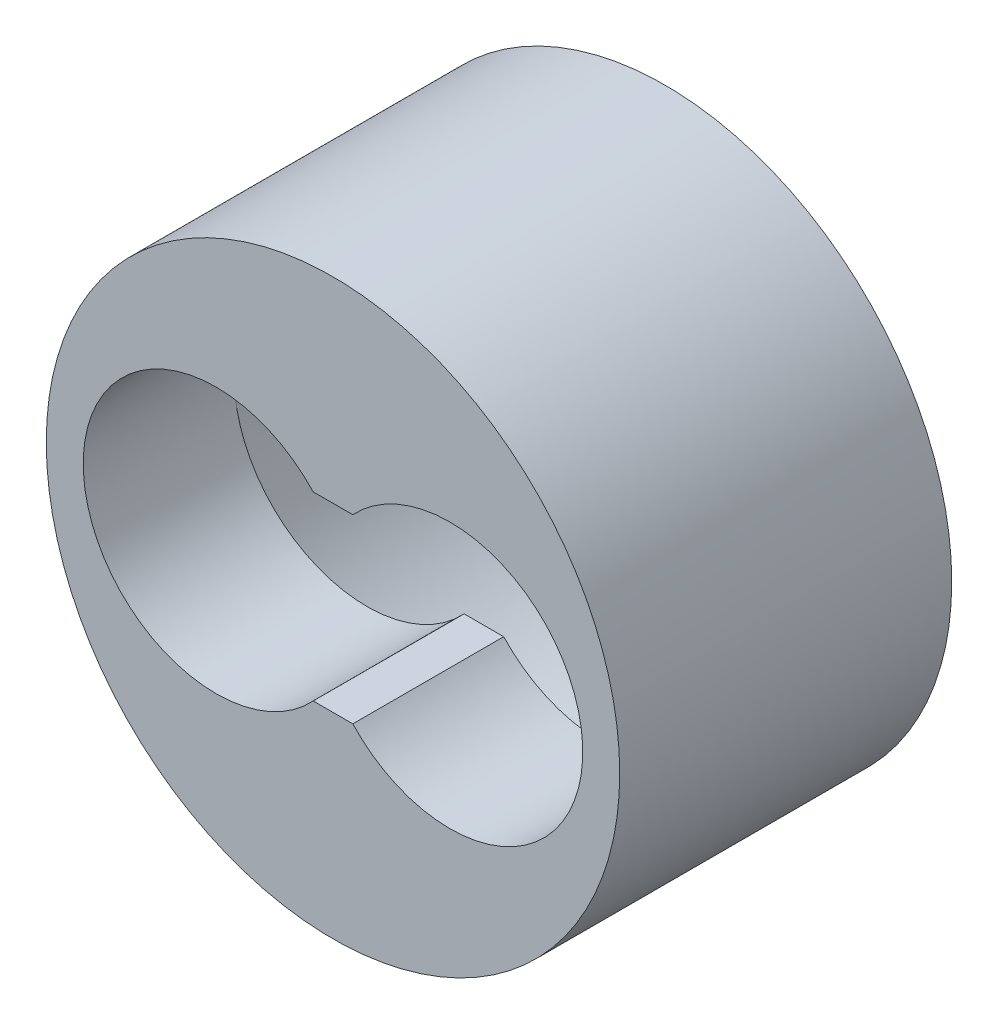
from build123d import *

# Parameters (mm, degrees)
SKETCH1_R           = 9.5
BOSS_EXTRUDE1_DEPTH = 5
BOSS_EXTRUDE2_START = -6
SKETCH2_R           = 9.5
SKETCH2_R_2         = 8.275
BOSS_EXTRUDE2_DEPTH = 6
SKETCH3_W           = 6
SKETCH3_H           = 3
CUT_EXTRUDE1_DEPTH  = 10


with BuildPart() as part:
    # Sketch1 → Boss-Extrude1 (new body)
    with BuildSketch(Plane(origin=(0, 0, 0), x_dir=(0, 1, 0), z_dir=(0, 0, 1))):
        with Locations(Location((0, 0, 0), (0, 0, 270))):
            Circle(SKETCH1_R)
        with BuildLine():
            ThreePointArc((2.084316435, 0), (0, 8.275), (-2.084316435, 0))
            ThreePointArc((-2.084316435, 0), (0, -8.275), (2.084316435, 0))
        make_face(mode=Mode.SUBTRACT)
    extrude(amount=BOSS_EXTRUDE1_DEPTH)

    # Sketch2 → Boss-Extrude2 (add)
    with BuildSketch(Plane(origin=(0, 0, 0), x_dir=(0, 1, 0), z_dir=(0, 0, 1)).offset(BOSS_EXTRUDE2_START)):
        with Locations(Location((0, 0, 0), (0, 0, 270))):
            Circle(SKETCH2_R)
        with Locations(Location((0, 0, 0), (0, 0, 270))):
            Circle(SKETCH2_R_2, mode=Mode.SUBTRACT)
    extrude(amount=BOSS_EXTRUDE2_DEPTH)

    # Sketch3 → Cut-Extrude1 (cut)
    with BuildSketch(Plane(origin=(0, 0, 0), x_dir=(0, 1, 0), z_dir=(0, 0, 1))):
        Rectangle(SKETCH3_W, SKETCH3_H)
    extrude(amount=CUT_EXTRUDE1_DEPTH, mode=Mode.SUBTRACT)


solid = part.part
